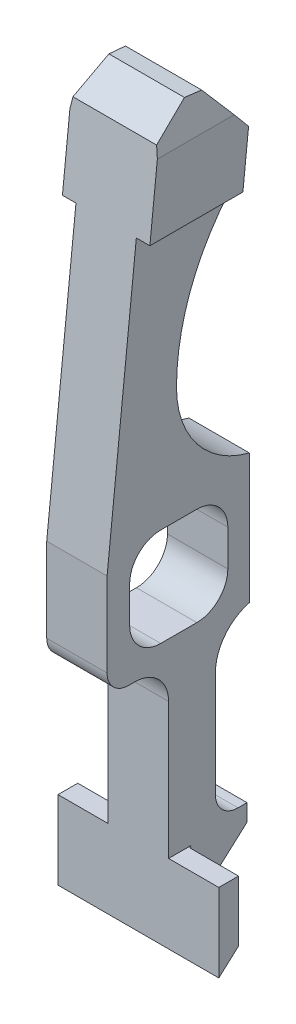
from build123d import *

# Parameters (mm, degrees)
BOSS_EXTRUDE1_DEPTH = 1.3589
BOSS_EXTRUDE2_DEPTH = 1.9685
CUT_EXTRUDE1_DEPTH  = 20.44321548
BOSS_EXTRUDE3_DEPTH = 2.2606
CUT_EXTRUDE2_DEPTH  = 4.9403
FILLET1_R           = 0.127


with BuildPart() as part:
    # Sketch1 → Boss-Extrude1 (new, symmetric)
    with BuildSketch(Plane(origin=(0, 0, 0), x_dir=(0, 0, -1), z_dir=(1, 0, 0))):
        with BuildLine():
            Line((3.175, 0.056100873), (3.175, 3.226261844))
            ThreePointArc((3.175, 3.226261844), (0.814790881, 4.757067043), (-0.1016, 7.4168))
            ThreePointArc((-0.1016, 7.4168), (0.503271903, 10.825297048), (2.244019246, 13.817540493))
            Line((2.244019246, 13.817540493), (2.278730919, 14.1478))
            Line((2.278730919, 14.1478), (-1.90981437, 14.1478))
            Line((-1.90981437, 14.1478), (-3.2258, 1.627033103))
            Line((-3.2258, 1.627033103), (-3.2258, -2.158390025))
            ThreePointArc((-3.2258, -2.158390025), (-2.942920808, -2.841320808), (-2.259990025, -3.1242))
            Line((-2.259990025, -3.1242), (-1.9812, -3.1242))
            ThreePointArc((-1.9812, -3.1242), (-0.903569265, -3.570569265), (-0.4572, -4.6482))
            Line((-0.4572, -4.6482), (-0.4572, -14.3002))
            Line((-0.4572, -14.3002), (3.0734, -11.121233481))
            Line((3.0734, -11.121233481), (3.0734, -10.359233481))
            Line((3.0734, -10.359233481), (2.667, -10.359233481))
            ThreePointArc((2.667, -10.359233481), (1.94857951, -10.061653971), (1.651, -9.343233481))
            Line((1.651, -9.343233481), (1.651, -4.58367554))
            ThreePointArc((1.651, -4.58367554), (2.076562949, -3.339334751), (3.175, -2.6162))
            Line((3.175, -2.6162), (3.175, 0.056100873))
        make_face()
    extrude(amount=BOSS_EXTRUDE1_DEPTH, both=True)

    # Sketch1_4 → Boss-Extrude2 (add, symmetric)
    with BuildSketch(Plane(origin=(0, 0, 0), x_dir=(0, 0, -1), z_dir=(1, 0, 0))):
        Polygon((-1.90981437, 14.1478), (2.278730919, 14.1478), (2.534906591, 16.585148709), (0.673758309, 18.803178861), (-0.084067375, 18.88282955), (-1.521942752, 17.838151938), align=None)
    extrude(amount=BOSS_EXTRUDE2_DEPTH, both=True)

    # Sketch2 → Cut-Extrude1 (cut, through all)
    with BuildSketch(Plane(origin=(1.3589, 0, 0), x_dir=(0, 0, -1), z_dir=(1, 0, 0))):
        with BuildLine():
            Line((-0.8128, 2.2098), (0.8128, 2.2098))
            ThreePointArc((0.8128, 2.2098), (1.800628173, 1.800628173), (2.2098, 0.8128))
            Line((2.2098, 0.8128), (2.2098, -0.8128))
            ThreePointArc((2.2098, -0.8128), (1.800628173, -1.800628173), (0.8128, -2.2098))
            Line((0.8128, -2.2098), (-0.8128, -2.2098))
            ThreePointArc((-0.8128, -2.2098), (-1.800628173, -1.800628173), (-2.2098, -0.8128))
            Line((-2.2098, -0.8128), (-2.2098, 0.8128))
            ThreePointArc((-2.2098, 0.8128), (-1.800628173, 1.800628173), (-0.8128, 2.2098))
        make_face()
    extrude(amount=-CUT_EXTRUDE1_DEPTH, mode=Mode.SUBTRACT)

    # Sketch3 → Boss-Extrude3 (add)
    with BuildSketch(Plane(origin=(1.3589, 0, 0), x_dir=(0, 0, -1), z_dir=(1, 0, 0))):
        Polygon((-0.4572, -10.7696), (0.4318, -10.7696), (0.4318, -13.499740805), (-0.4572, -14.3002), align=None)
    boss_extrude3 = extrude(amount=BOSS_EXTRUDE3_DEPTH)

    # Mirror1: Boss-Extrude3 across plane
    add(boss_extrude3.mirror(Plane(origin=(0, 0, 0), x_dir=(0, 0, 1), z_dir=(1, 0, 0))))

    # Sketch4 → Cut-Extrude2 (cut, symmetric)
    with BuildSketch(Plane.XY):
        Polygon((-1.9685, 19.111820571), (-1.9685, 18.803178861), (-1.9685, 17.35882955), (-1.659400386, 19.111820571), align=None)
        Polygon((1.9685, 19.111820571), (1.9685, 17.35882955), (1.659400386, 19.111820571), align=None)
    extrude(amount=CUT_EXTRUDE2_DEPTH, both=True, mode=Mode.SUBTRACT)

    # Fillet1
    fillet1_edges = [part.edges().sort_by_distance(p)[0] for p in [
        (1.3589, -12.134670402, -0.4318),
        (-1.3589, -12.134670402, -0.4318),
    ]]
    fillet(fillet1_edges, radius=FILLET1_R)


solid = part.part
